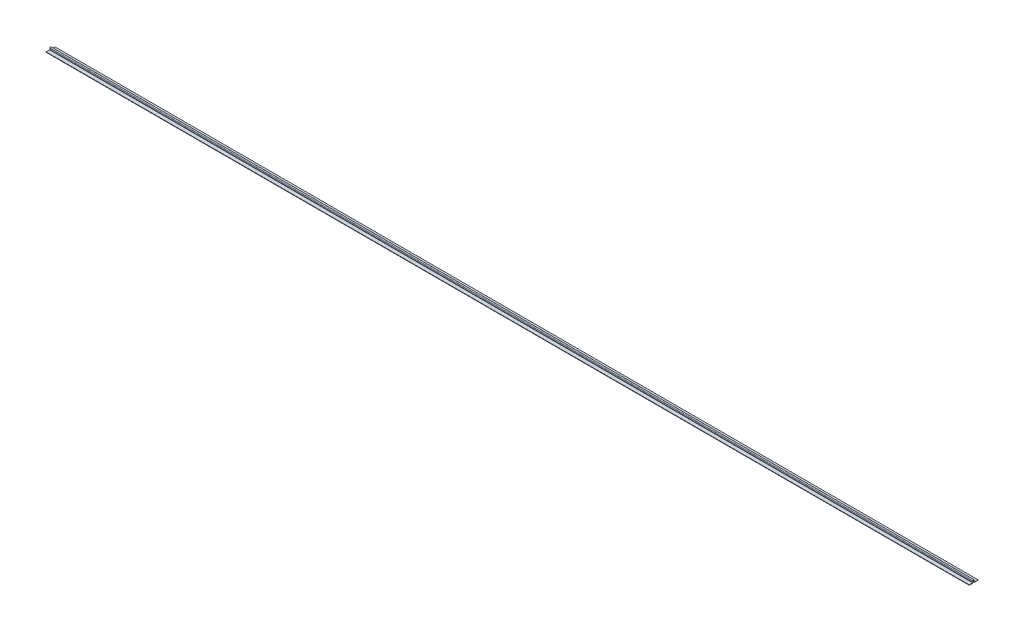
ISO-10303-21;
HEADER;
FILE_DESCRIPTION(('STEP AP214'),'2;1');
FILE_NAME('part.step','',(''),(''),'','','');
FILE_SCHEMA(('AUTOMOTIVE_DESIGN { 1 0 10303 214 1 1 1 1 }'));
ENDSEC;
DATA;
#1=APPLICATION_CONTEXT('core data for automotive mechanical design processes');
#2=APPLICATION_PROTOCOL_DEFINITION('international standard','automotive_design',2000,#1);
#3=PRODUCT_CONTEXT('',#1,'mechanical');
#4=PRODUCT('Part','Part','',(#3));
#5=PRODUCT_RELATED_PRODUCT_CATEGORY('part','',(#4));
#6=PRODUCT_DEFINITION_FORMATION('','',#4);
#7=PRODUCT_DEFINITION_CONTEXT('part definition',#1,'design');
#8=PRODUCT_DEFINITION('design','',#6,#7);
#9=PRODUCT_DEFINITION_SHAPE('','',#8);
#10=(LENGTH_UNIT() NAMED_UNIT(*) SI_UNIT(.MILLI.,.METRE.));
#11=(NAMED_UNIT(*) PLANE_ANGLE_UNIT() SI_UNIT($,.RADIAN.));
#12=(NAMED_UNIT(*) SI_UNIT($,.STERADIAN.) SOLID_ANGLE_UNIT());
#13=UNCERTAINTY_MEASURE_WITH_UNIT(LENGTH_MEASURE(1.E-05),#10,'distance_accuracy_value','');
#14=(GEOMETRIC_REPRESENTATION_CONTEXT(3) GLOBAL_UNCERTAINTY_ASSIGNED_CONTEXT((#13)) GLOBAL_UNIT_ASSIGNED_CONTEXT((#10,
#11,#12)) REPRESENTATION_CONTEXT('',''));
#15=CARTESIAN_POINT('',(0.,0.,0.));
#16=DIRECTION('',(0.,0.,1.));
#17=DIRECTION('',(1.,0.,0.));
#18=AXIS2_PLACEMENT_3D('',#15,#16,#17);
#19=CARTESIAN_POINT('',(1227.5,4.,-1.75));
#20=DIRECTION('',(0.,0.,-1.));
#21=DIRECTION('',(0.,1.,0.));
#22=AXIS2_PLACEMENT_3D('',#19,#20,#21);
#23=PLANE('',#22);
#24=DIRECTION('',(0.,-1.,0.));
#25=VECTOR('',#24,1.);
#26=CARTESIAN_POINT('',(-1227.5,4.,-1.75));
#27=LINE('',#26,#25);
#28=CARTESIAN_POINT('',(-1227.5,4.,-1.75));
#29=VERTEX_POINT('',#28);
#30=CARTESIAN_POINT('',(-1227.5,0.5,-1.75));
#31=VERTEX_POINT('',#30);
#32=EDGE_CURVE('E179',#29,#31,#27,.T.);
#33=ORIENTED_EDGE('',*,*,#32,.F.);
#34=DIRECTION('',(-1.,0.,0.));
#35=VECTOR('',#34,1.);
#36=CARTESIAN_POINT('',(1227.5,4.,-1.75));
#37=LINE('',#36,#35);
#38=CARTESIAN_POINT('',(1227.5,4.,-1.75));
#39=VERTEX_POINT('',#38);
#40=EDGE_CURVE('E11',#39,#29,#37,.T.);
#41=ORIENTED_EDGE('',*,*,#40,.F.);
#42=DIRECTION('',(0.,-1.,0.));
#43=VECTOR('',#42,1.);
#44=CARTESIAN_POINT('',(1227.5,4.,-1.75));
#45=LINE('',#44,#43);
#46=CARTESIAN_POINT('',(1227.5,0.5,-1.75));
#47=VERTEX_POINT('',#46);
#48=EDGE_CURVE('E218',#39,#47,#45,.T.);
#49=ORIENTED_EDGE('',*,*,#48,.T.);
#50=DIRECTION('',(-1.,0.,0.));
#51=VECTOR('',#50,1.);
#52=CARTESIAN_POINT('',(1227.5,0.5,-1.75));
#53=LINE('',#52,#51);
#54=EDGE_CURVE('E36',#47,#31,#53,.T.);
#55=ORIENTED_EDGE('',*,*,#54,.T.);
#56=EDGE_LOOP('',(#33,#41,#49,#55));
#57=FACE_BOUND('',#56,.T.);
#58=ADVANCED_FACE('F33',(#57),#23,.T.);
#59=CARTESIAN_POINT('',(1227.5,4.,0.));
#60=DIRECTION('',(-1.,0.,0.));
#61=DIRECTION('',(0.,0.,1.));
#62=AXIS2_PLACEMENT_3D('',#59,#60,#61);
#63=CYLINDRICAL_SURFACE('',#62,1.75);
#64=CARTESIAN_POINT('',(-1227.5,4.,0.));
#65=DIRECTION('',(1.,0.,0.));
#66=DIRECTION('',(0.,0.,-1.));
#67=AXIS2_PLACEMENT_3D('',#64,#65,#66);
#68=CIRCLE('',#67,1.75);
#69=CARTESIAN_POINT('',(-1227.5,4.,1.75));
#70=VERTEX_POINT('',#69);
#71=EDGE_CURVE('E102',#29,#70,#68,.T.);
#72=ORIENTED_EDGE('',*,*,#71,.T.);
#73=DIRECTION('',(-1.,0.,0.));
#74=VECTOR('',#73,1.);
#75=CARTESIAN_POINT('',(1227.5,4.,1.75));
#76=LINE('',#75,#74);
#77=CARTESIAN_POINT('',(1227.5,4.,1.75));
#78=VERTEX_POINT('',#77);
#79=EDGE_CURVE('E42',#78,#70,#76,.T.);
#80=ORIENTED_EDGE('',*,*,#79,.F.);
#81=CARTESIAN_POINT('',(1227.5,4.,0.));
#82=DIRECTION('',(1.,0.,0.));
#83=DIRECTION('',(0.,0.,-1.));
#84=AXIS2_PLACEMENT_3D('',#81,#82,#83);
#85=CIRCLE('',#84,1.75);
#86=EDGE_CURVE('E157',#39,#78,#85,.T.);
#87=ORIENTED_EDGE('',*,*,#86,.F.);
#88=ORIENTED_EDGE('',*,*,#40,.T.);
#89=EDGE_LOOP('',(#72,#80,#87,#88));
#90=FACE_BOUND('',#89,.T.);
#91=ADVANCED_FACE('F332',(#90),#63,.T.);
#92=CARTESIAN_POINT('',(1227.5,4.,1.75));
#93=DIRECTION('',(0.,0.,-1.));
#94=DIRECTION('',(0.,1.,0.));
#95=AXIS2_PLACEMENT_3D('',#92,#93,#94);
#96=PLANE('',#95);
#97=DIRECTION('',(0.,-1.,0.));
#98=VECTOR('',#97,1.);
#99=CARTESIAN_POINT('',(-1227.5,4.,1.75));
#100=LINE('',#99,#98);
#101=CARTESIAN_POINT('',(-1227.5,0.5,1.75));
#102=VERTEX_POINT('',#101);
#103=EDGE_CURVE('E164',#70,#102,#100,.T.);
#104=ORIENTED_EDGE('',*,*,#103,.T.);
#105=DIRECTION('',(-1.,0.,0.));
#106=VECTOR('',#105,1.);
#107=CARTESIAN_POINT('',(1227.5,0.5,1.75));
#108=LINE('',#107,#106);
#109=CARTESIAN_POINT('',(1227.5,0.5,1.75));
#110=VERTEX_POINT('',#109);
#111=EDGE_CURVE('E161',#110,#102,#108,.T.);
#112=ORIENTED_EDGE('',*,*,#111,.F.);
#113=DIRECTION('',(0.,-1.,0.));
#114=VECTOR('',#113,1.);
#115=CARTESIAN_POINT('',(1227.5,4.,1.75));
#116=LINE('',#115,#114);
#117=EDGE_CURVE('E151',#78,#110,#116,.T.);
#118=ORIENTED_EDGE('',*,*,#117,.F.);
#119=ORIENTED_EDGE('',*,*,#79,.T.);
#120=EDGE_LOOP('',(#104,#112,#118,#119));
#121=FACE_BOUND('',#120,.T.);
#122=ADVANCED_FACE('F162',(#121),#96,.F.);
#123=CARTESIAN_POINT('',(1227.5,0.5,2.25));
#124=DIRECTION('',(-1.,0.,0.));
#125=DIRECTION('',(0.,0.,1.));
#126=AXIS2_PLACEMENT_3D('',#123,#124,#125);
#127=CYLINDRICAL_SURFACE('',#126,0.5);
#128=CARTESIAN_POINT('',(-1227.5,0.5,2.25));
#129=DIRECTION('',(-1.,0.,0.));
#130=DIRECTION('',(0.,0.,1.));
#131=AXIS2_PLACEMENT_3D('',#128,#129,#130);
#132=CIRCLE('',#131,0.5);
#133=CARTESIAN_POINT('',(-1227.5,0.,2.25));
#134=VERTEX_POINT('',#133);
#135=EDGE_CURVE('E215',#102,#134,#132,.T.);
#136=ORIENTED_EDGE('',*,*,#135,.T.);
#137=DIRECTION('',(-1.,0.,0.));
#138=VECTOR('',#137,1.);
#139=CARTESIAN_POINT('',(1227.5,0.,2.25));
#140=LINE('',#139,#138);
#141=CARTESIAN_POINT('',(1227.5,0.,2.25));
#142=VERTEX_POINT('',#141);
#143=EDGE_CURVE('E167',#142,#134,#140,.T.);
#144=ORIENTED_EDGE('',*,*,#143,.F.);
#145=CARTESIAN_POINT('',(1227.5,0.5,2.25));
#146=DIRECTION('',(-1.,0.,0.));
#147=DIRECTION('',(0.,0.,1.));
#148=AXIS2_PLACEMENT_3D('',#145,#146,#147);
#149=CIRCLE('',#148,0.5);
#150=EDGE_CURVE('E155',#110,#142,#149,.T.);
#151=ORIENTED_EDGE('',*,*,#150,.F.);
#152=ORIENTED_EDGE('',*,*,#111,.T.);
#153=EDGE_LOOP('',(#136,#144,#151,#152));
#154=FACE_BOUND('',#153,.T.);
#155=ADVANCED_FACE('F169',(#154),#127,.F.);
#156=CARTESIAN_POINT('',(1227.5,0.,2.25));
#157=DIRECTION('',(0.,-1.,0.));
#158=DIRECTION('',(0.,0.,-1.));
#159=AXIS2_PLACEMENT_3D('',#156,#157,#158);
#160=PLANE('',#159);
#161=DIRECTION('',(0.,0.,1.));
#162=VECTOR('',#161,1.);
#163=CARTESIAN_POINT('',(-1227.5,0.,2.25));
#164=LINE('',#163,#162);
#165=CARTESIAN_POINT('',(-1227.5,0.,11.75));
#166=VERTEX_POINT('',#165);
#167=EDGE_CURVE('E213',#134,#166,#164,.T.);
#168=ORIENTED_EDGE('',*,*,#167,.T.);
#169=DIRECTION('',(-1.,0.,0.));
#170=VECTOR('',#169,1.);
#171=CARTESIAN_POINT('',(1227.5,0.,11.75));
#172=LINE('',#171,#170);
#173=CARTESIAN_POINT('',(1227.5,0.,11.75));
#174=VERTEX_POINT('',#173);
#175=EDGE_CURVE('E222',#174,#166,#172,.T.);
#176=ORIENTED_EDGE('',*,*,#175,.F.);
#177=DIRECTION('',(0.,0.,1.));
#178=VECTOR('',#177,1.);
#179=CARTESIAN_POINT('',(1227.5,0.,2.25));
#180=LINE('',#179,#178);
#181=EDGE_CURVE('E172',#142,#174,#180,.T.);
#182=ORIENTED_EDGE('',*,*,#181,.F.);
#183=ORIENTED_EDGE('',*,*,#143,.T.);
#184=EDGE_LOOP('',(#168,#176,#182,#183));
#185=FACE_BOUND('',#184,.T.);
#186=ADVANCED_FACE('F255',(#185),#160,.F.);
#187=CARTESIAN_POINT('',(1227.5,0.,11.75));
#188=DIRECTION('',(0.,0.,-1.));
#189=DIRECTION('',(-1.,0.,0.));
#190=AXIS2_PLACEMENT_3D('',#187,#188,#189);
#191=PLANE('',#190);
#192=DIRECTION('',(0.,-1.,0.));
#193=VECTOR('',#192,1.);
#194=CARTESIAN_POINT('',(-1227.5,0.,11.75));
#195=LINE('',#194,#193);
#196=CARTESIAN_POINT('',(-1227.5,-1.,11.75));
#197=VERTEX_POINT('',#196);
#198=EDGE_CURVE('E211',#166,#197,#195,.T.);
#199=ORIENTED_EDGE('',*,*,#198,.T.);
#200=DIRECTION('',(-1.,0.,0.));
#201=VECTOR('',#200,1.);
#202=CARTESIAN_POINT('',(1227.5,-1.,11.75));
#203=LINE('',#202,#201);
#204=CARTESIAN_POINT('',(1227.5,-1.,11.75));
#205=VERTEX_POINT('',#204);
#206=EDGE_CURVE('E225',#205,#197,#203,.T.);
#207=ORIENTED_EDGE('',*,*,#206,.F.);
#208=DIRECTION('',(0.,-1.,0.));
#209=VECTOR('',#208,1.);
#210=CARTESIAN_POINT('',(1227.5,0.,11.75));
#211=LINE('',#210,#209);
#212=EDGE_CURVE('E174',#174,#205,#211,.T.);
#213=ORIENTED_EDGE('',*,*,#212,.F.);
#214=ORIENTED_EDGE('',*,*,#175,.T.);
#215=EDGE_LOOP('',(#199,#207,#213,#214));
#216=FACE_BOUND('',#215,.T.);
#217=ADVANCED_FACE('F264',(#216),#191,.F.);
#218=CARTESIAN_POINT('',(1227.5,-1.,11.75));
#219=DIRECTION('',(0.,1.,0.));
#220=DIRECTION('',(0.,0.,1.));
#221=AXIS2_PLACEMENT_3D('',#218,#219,#220);
#222=PLANE('',#221);
#223=DIRECTION('',(0.,0.,-1.));
#224=VECTOR('',#223,1.);
#225=CARTESIAN_POINT('',(-1227.5,-1.,11.75));
#226=LINE('',#225,#224);
#227=CARTESIAN_POINT('',(-1227.5,-1.,1.75));
#228=VERTEX_POINT('',#227);
#229=EDGE_CURVE('E208',#197,#228,#226,.T.);
#230=ORIENTED_EDGE('',*,*,#229,.T.);
#231=DIRECTION('',(-1.,0.,0.));
#232=VECTOR('',#231,1.);
#233=CARTESIAN_POINT('',(1227.5,-1.,1.75));
#234=LINE('',#233,#232);
#235=CARTESIAN_POINT('',(1227.5,-1.,1.75));
#236=VERTEX_POINT('',#235);
#237=EDGE_CURVE('E228',#236,#228,#234,.T.);
#238=ORIENTED_EDGE('',*,*,#237,.F.);
#239=DIRECTION('',(0.,0.,-1.));
#240=VECTOR('',#239,1.);
#241=CARTESIAN_POINT('',(1227.5,-1.,11.75));
#242=LINE('',#241,#240);
#243=EDGE_CURVE('E261',#205,#236,#242,.T.);
#244=ORIENTED_EDGE('',*,*,#243,.F.);
#245=ORIENTED_EDGE('',*,*,#206,.T.);
#246=EDGE_LOOP('',(#230,#238,#244,#245));
#247=FACE_BOUND('',#246,.T.);
#248=ADVANCED_FACE('F267',(#247),#222,.F.);
#249=CARTESIAN_POINT('',(1227.5,0.,1.75));
#250=DIRECTION('',(-1.,0.,0.));
#251=DIRECTION('',(0.,0.,1.));
#252=AXIS2_PLACEMENT_3D('',#249,#250,#251);
#253=CYLINDRICAL_SURFACE('',#252,1.);
#254=CARTESIAN_POINT('',(-1227.5,0.,1.75));
#255=DIRECTION('',(-1.,0.,0.));
#256=DIRECTION('',(0.,0.,1.));
#257=AXIS2_PLACEMENT_3D('',#254,#255,#256);
#258=CIRCLE('',#257,1.);
#259=CARTESIAN_POINT('',(-1227.5,0.,0.749999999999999));
#260=VERTEX_POINT('',#259);
#261=EDGE_CURVE('E205',#260,#228,#258,.T.);
#262=ORIENTED_EDGE('',*,*,#261,.F.);
#263=DIRECTION('',(-1.,0.,0.));
#264=VECTOR('',#263,1.);
#265=CARTESIAN_POINT('',(1227.5,0.,0.749999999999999));
#266=LINE('',#265,#264);
#267=CARTESIAN_POINT('',(1227.5,0.,0.749999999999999));
#268=VERTEX_POINT('',#267);
#269=EDGE_CURVE('E230',#268,#260,#266,.T.);
#270=ORIENTED_EDGE('',*,*,#269,.F.);
#271=CARTESIAN_POINT('',(1227.5,0.,1.75));
#272=DIRECTION('',(-1.,0.,0.));
#273=DIRECTION('',(0.,0.,1.));
#274=AXIS2_PLACEMENT_3D('',#271,#272,#273);
#275=CIRCLE('',#274,1.);
#276=EDGE_CURVE('E269',#268,#236,#275,.T.);
#277=ORIENTED_EDGE('',*,*,#276,.T.);
#278=ORIENTED_EDGE('',*,*,#237,.T.);
#279=EDGE_LOOP('',(#262,#270,#277,#278));
#280=FACE_BOUND('',#279,.T.);
#281=ADVANCED_FACE('F322',(#280),#253,.T.);
#282=CARTESIAN_POINT('',(1227.5,0.5,0.749999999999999));
#283=DIRECTION('',(0.,0.,-1.));
#284=DIRECTION('',(-1.,0.,0.));
#285=AXIS2_PLACEMENT_3D('',#282,#283,#284);
#286=PLANE('',#285);
#287=DIRECTION('',(0.,-1.,0.));
#288=VECTOR('',#287,1.);
#289=CARTESIAN_POINT('',(-1227.5,0.5,0.749999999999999));
#290=LINE('',#289,#288);
#291=CARTESIAN_POINT('',(-1227.5,4.,0.75));
#292=VERTEX_POINT('',#291);
#293=EDGE_CURVE('E202',#292,#260,#290,.T.);
#294=ORIENTED_EDGE('',*,*,#293,.F.);
#295=DIRECTION('',(-1.,0.,0.));
#296=VECTOR('',#295,1.);
#297=CARTESIAN_POINT('',(1227.5,4.,0.75));
#298=LINE('',#297,#296);
#299=CARTESIAN_POINT('',(1227.5,4.,0.75));
#300=VERTEX_POINT('',#299);
#301=EDGE_CURVE('E232',#300,#292,#298,.T.);
#302=ORIENTED_EDGE('',*,*,#301,.F.);
#303=DIRECTION('',(0.,-1.,0.));
#304=VECTOR('',#303,1.);
#305=CARTESIAN_POINT('',(1227.5,4.,0.75));
#306=LINE('',#305,#304);
#307=EDGE_CURVE('E271',#300,#268,#306,.T.);
#308=ORIENTED_EDGE('',*,*,#307,.T.);
#309=ORIENTED_EDGE('',*,*,#269,.T.);
#310=EDGE_LOOP('',(#294,#302,#308,#309));
#311=FACE_BOUND('',#310,.T.);
#312=ADVANCED_FACE('F318',(#311),#286,.T.);
#313=CARTESIAN_POINT('',(1227.5,4.,0.));
#314=DIRECTION('',(-1.,0.,0.));
#315=DIRECTION('',(0.,0.,1.));
#316=AXIS2_PLACEMENT_3D('',#313,#314,#315);
#317=CYLINDRICAL_SURFACE('',#316,0.75);
#318=CARTESIAN_POINT('',(-1227.5,4.,0.));
#319=DIRECTION('',(1.,0.,0.));
#320=DIRECTION('',(0.,0.,-1.));
#321=AXIS2_PLACEMENT_3D('',#318,#319,#320);
#322=CIRCLE('',#321,0.75);
#323=CARTESIAN_POINT('',(-1227.5,4.,-0.75));
#324=VERTEX_POINT('',#323);
#325=EDGE_CURVE('E199',#324,#292,#322,.T.);
#326=ORIENTED_EDGE('',*,*,#325,.F.);
#327=DIRECTION('',(-1.,0.,0.));
#328=VECTOR('',#327,1.);
#329=CARTESIAN_POINT('',(1227.5,4.,-0.75));
#330=LINE('',#329,#328);
#331=CARTESIAN_POINT('',(1227.5,4.,-0.75));
#332=VERTEX_POINT('',#331);
#333=EDGE_CURVE('E235',#332,#324,#330,.T.);
#334=ORIENTED_EDGE('',*,*,#333,.F.);
#335=CARTESIAN_POINT('',(1227.5,4.,0.));
#336=DIRECTION('',(1.,0.,0.));
#337=DIRECTION('',(0.,0.,-1.));
#338=AXIS2_PLACEMENT_3D('',#335,#336,#337);
#339=CIRCLE('',#338,0.75);
#340=EDGE_CURVE('E275',#332,#300,#339,.T.);
#341=ORIENTED_EDGE('',*,*,#340,.T.);
#342=ORIENTED_EDGE('',*,*,#301,.T.);
#343=EDGE_LOOP('',(#326,#334,#341,#342));
#344=FACE_BOUND('',#343,.T.);
#345=ADVANCED_FACE('F314',(#344),#317,.F.);
#346=CARTESIAN_POINT('',(1227.5,4.,-0.75));
#347=DIRECTION('',(0.,0.,-1.));
#348=DIRECTION('',(0.,1.,0.));
#349=AXIS2_PLACEMENT_3D('',#346,#347,#348);
#350=PLANE('',#349);
#351=DIRECTION('',(0.,-1.,0.));
#352=VECTOR('',#351,1.);
#353=CARTESIAN_POINT('',(-1227.5,4.,-0.75));
#354=LINE('',#353,#352);
#355=CARTESIAN_POINT('',(-1227.5,0.,-0.75));
#356=VERTEX_POINT('',#355);
#357=EDGE_CURVE('E197',#324,#356,#354,.T.);
#358=ORIENTED_EDGE('',*,*,#357,.T.);
#359=DIRECTION('',(-1.,0.,0.));
#360=VECTOR('',#359,1.);
#361=CARTESIAN_POINT('',(1227.5,0.,-0.75));
#362=LINE('',#361,#360);
#363=CARTESIAN_POINT('',(1227.5,0.,-0.75));
#364=VERTEX_POINT('',#363);
#365=EDGE_CURVE('E237',#364,#356,#362,.T.);
#366=ORIENTED_EDGE('',*,*,#365,.F.);
#367=DIRECTION('',(0.,-1.,0.));
#368=VECTOR('',#367,1.);
#369=CARTESIAN_POINT('',(1227.5,0.5,-0.75));
#370=LINE('',#369,#368);
#371=EDGE_CURVE('E278',#332,#364,#370,.T.);
#372=ORIENTED_EDGE('',*,*,#371,.F.);
#373=ORIENTED_EDGE('',*,*,#333,.T.);
#374=EDGE_LOOP('',(#358,#366,#372,#373));
#375=FACE_BOUND('',#374,.T.);
#376=ADVANCED_FACE('F310',(#375),#350,.F.);
#377=CARTESIAN_POINT('',(1227.5,0.,-1.75));
#378=DIRECTION('',(-1.,0.,0.));
#379=DIRECTION('',(0.,0.,1.));
#380=AXIS2_PLACEMENT_3D('',#377,#378,#379);
#381=CYLINDRICAL_SURFACE('',#380,1.);
#382=CARTESIAN_POINT('',(-1227.5,0.,-1.75));
#383=DIRECTION('',(-1.,0.,0.));
#384=DIRECTION('',(0.,0.,1.));
#385=AXIS2_PLACEMENT_3D('',#382,#383,#384);
#386=CIRCLE('',#385,1.);
#387=CARTESIAN_POINT('',(-1227.5,-1.,-1.75));
#388=VERTEX_POINT('',#387);
#389=EDGE_CURVE('E194',#388,#356,#386,.T.);
#390=ORIENTED_EDGE('',*,*,#389,.F.);
#391=DIRECTION('',(-1.,0.,0.));
#392=VECTOR('',#391,1.);
#393=CARTESIAN_POINT('',(1227.5,-1.,-1.75));
#394=LINE('',#393,#392);
#395=CARTESIAN_POINT('',(1227.5,-1.,-1.75));
#396=VERTEX_POINT('',#395);
#397=EDGE_CURVE('E240',#396,#388,#394,.T.);
#398=ORIENTED_EDGE('',*,*,#397,.F.);
#399=CARTESIAN_POINT('',(1227.5,0.,-1.75));
#400=DIRECTION('',(-1.,0.,0.));
#401=DIRECTION('',(0.,0.,1.));
#402=AXIS2_PLACEMENT_3D('',#399,#400,#401);
#403=CIRCLE('',#402,1.);
#404=EDGE_CURVE('E280',#396,#364,#403,.T.);
#405=ORIENTED_EDGE('',*,*,#404,.T.);
#406=ORIENTED_EDGE('',*,*,#365,.T.);
#407=EDGE_LOOP('',(#390,#398,#405,#406));
#408=FACE_BOUND('',#407,.T.);
#409=ADVANCED_FACE('F307',(#408),#381,.T.);
#410=CARTESIAN_POINT('',(1227.5,-1.,-11.75));
#411=DIRECTION('',(0.,-1.,0.));
#412=DIRECTION('',(0.,0.,-1.));
#413=AXIS2_PLACEMENT_3D('',#410,#411,#412);
#414=PLANE('',#413);
#415=DIRECTION('',(0.,0.,1.));
#416=VECTOR('',#415,1.);
#417=CARTESIAN_POINT('',(-1227.5,-1.,-11.75));
#418=LINE('',#417,#416);
#419=CARTESIAN_POINT('',(-1227.5,-1.,-11.75));
#420=VERTEX_POINT('',#419);
#421=EDGE_CURVE('E191',#420,#388,#418,.T.);
#422=ORIENTED_EDGE('',*,*,#421,.F.);
#423=DIRECTION('',(-1.,0.,0.));
#424=VECTOR('',#423,1.);
#425=CARTESIAN_POINT('',(1227.5,-1.,-11.75));
#426=LINE('',#425,#424);
#427=CARTESIAN_POINT('',(1227.5,-1.,-11.75));
#428=VERTEX_POINT('',#427);
#429=EDGE_CURVE('E242',#428,#420,#426,.T.);
#430=ORIENTED_EDGE('',*,*,#429,.F.);
#431=DIRECTION('',(0.,0.,1.));
#432=VECTOR('',#431,1.);
#433=CARTESIAN_POINT('',(1227.5,-1.,-11.75));
#434=LINE('',#433,#432);
#435=EDGE_CURVE('E283',#428,#396,#434,.T.);
#436=ORIENTED_EDGE('',*,*,#435,.T.);
#437=ORIENTED_EDGE('',*,*,#397,.T.);
#438=EDGE_LOOP('',(#422,#430,#436,#437));
#439=FACE_BOUND('',#438,.T.);
#440=ADVANCED_FACE('F305',(#439),#414,.T.);
#441=CARTESIAN_POINT('',(1227.5,0.,-11.75));
#442=DIRECTION('',(0.,0.,-1.));
#443=DIRECTION('',(-1.,0.,0.));
#444=AXIS2_PLACEMENT_3D('',#441,#442,#443);
#445=PLANE('',#444);
#446=DIRECTION('',(0.,-1.,0.));
#447=VECTOR('',#446,1.);
#448=CARTESIAN_POINT('',(-1227.5,0.,-11.75));
#449=LINE('',#448,#447);
#450=CARTESIAN_POINT('',(-1227.5,0.,-11.75));
#451=VERTEX_POINT('',#450);
#452=EDGE_CURVE('E188',#451,#420,#449,.T.);
#453=ORIENTED_EDGE('',*,*,#452,.F.);
#454=DIRECTION('',(-1.,0.,0.));
#455=VECTOR('',#454,1.);
#456=CARTESIAN_POINT('',(1227.5,0.,-11.75));
#457=LINE('',#456,#455);
#458=CARTESIAN_POINT('',(1227.5,0.,-11.75));
#459=VERTEX_POINT('',#458);
#460=EDGE_CURVE('E244',#459,#451,#457,.T.);
#461=ORIENTED_EDGE('',*,*,#460,.F.);
#462=DIRECTION('',(0.,-1.,0.));
#463=VECTOR('',#462,1.);
#464=CARTESIAN_POINT('',(1227.5,0.,-11.75));
#465=LINE('',#464,#463);
#466=EDGE_CURVE('E286',#459,#428,#465,.T.);
#467=ORIENTED_EDGE('',*,*,#466,.T.);
#468=ORIENTED_EDGE('',*,*,#429,.T.);
#469=EDGE_LOOP('',(#453,#461,#467,#468));
#470=FACE_BOUND('',#469,.T.);
#471=ADVANCED_FACE('F300',(#470),#445,.T.);
#472=CARTESIAN_POINT('',(1227.5,0.,-2.25));
#473=DIRECTION('',(0.,1.,0.));
#474=DIRECTION('',(0.,0.,1.));
#475=AXIS2_PLACEMENT_3D('',#472,#473,#474);
#476=PLANE('',#475);
#477=DIRECTION('',(0.,0.,-1.));
#478=VECTOR('',#477,1.);
#479=CARTESIAN_POINT('',(-1227.5,0.,-2.25));
#480=LINE('',#479,#478);
#481=CARTESIAN_POINT('',(-1227.5,0.,-2.25));
#482=VERTEX_POINT('',#481);
#483=EDGE_CURVE('E185',#482,#451,#480,.T.);
#484=ORIENTED_EDGE('',*,*,#483,.F.);
#485=DIRECTION('',(-1.,0.,0.));
#486=VECTOR('',#485,1.);
#487=CARTESIAN_POINT('',(1227.5,0.,-2.25));
#488=LINE('',#487,#486);
#489=CARTESIAN_POINT('',(1227.5,0.,-2.25));
#490=VERTEX_POINT('',#489);
#491=EDGE_CURVE('E245',#490,#482,#488,.T.);
#492=ORIENTED_EDGE('',*,*,#491,.F.);
#493=DIRECTION('',(0.,0.,-1.));
#494=VECTOR('',#493,1.);
#495=CARTESIAN_POINT('',(1227.5,0.,-2.25));
#496=LINE('',#495,#494);
#497=EDGE_CURVE('E289',#490,#459,#496,.T.);
#498=ORIENTED_EDGE('',*,*,#497,.T.);
#499=ORIENTED_EDGE('',*,*,#460,.T.);
#500=EDGE_LOOP('',(#484,#492,#498,#499));
#501=FACE_BOUND('',#500,.T.);
#502=ADVANCED_FACE('F294',(#501),#476,.T.);
#503=CARTESIAN_POINT('',(1227.5,0.5,-2.25));
#504=DIRECTION('',(-1.,0.,0.));
#505=DIRECTION('',(0.,0.,1.));
#506=AXIS2_PLACEMENT_3D('',#503,#504,#505);
#507=CYLINDRICAL_SURFACE('',#506,0.5);
#508=CARTESIAN_POINT('',(-1227.5,0.5,-2.25));
#509=DIRECTION('',(-1.,0.,0.));
#510=DIRECTION('',(0.,0.,1.));
#511=AXIS2_PLACEMENT_3D('',#508,#509,#510);
#512=CIRCLE('',#511,0.5);
#513=EDGE_CURVE('E182',#482,#31,#512,.T.);
#514=ORIENTED_EDGE('',*,*,#513,.T.);
#515=ORIENTED_EDGE('',*,*,#54,.F.);
#516=CARTESIAN_POINT('',(1227.5,0.5,-2.25));
#517=DIRECTION('',(-1.,0.,0.));
#518=DIRECTION('',(0.,0.,1.));
#519=AXIS2_PLACEMENT_3D('',#516,#517,#518);
#520=CIRCLE('',#519,0.5);
#521=EDGE_CURVE('E112',#490,#47,#520,.T.);
#522=ORIENTED_EDGE('',*,*,#521,.F.);
#523=ORIENTED_EDGE('',*,*,#491,.T.);
#524=EDGE_LOOP('',(#514,#515,#522,#523));
#525=FACE_BOUND('',#524,.T.);
#526=ADVANCED_FACE('F248',(#525),#507,.F.);
#527=CARTESIAN_POINT('',(1227.5,0.5,-2.25));
#528=DIRECTION('',(-1.,0.,0.));
#529=DIRECTION('',(0.,0.,1.));
#530=AXIS2_PLACEMENT_3D('',#527,#528,#529);
#531=PLANE('',#530);
#532=ORIENTED_EDGE('',*,*,#48,.F.);
#533=ORIENTED_EDGE('',*,*,#86,.T.);
#534=ORIENTED_EDGE('',*,*,#117,.T.);
#535=ORIENTED_EDGE('',*,*,#150,.T.);
#536=ORIENTED_EDGE('',*,*,#181,.T.);
#537=ORIENTED_EDGE('',*,*,#212,.T.);
#538=ORIENTED_EDGE('',*,*,#243,.T.);
#539=ORIENTED_EDGE('',*,*,#276,.F.);
#540=ORIENTED_EDGE('',*,*,#307,.F.);
#541=ORIENTED_EDGE('',*,*,#340,.F.);
#542=ORIENTED_EDGE('',*,*,#371,.T.);
#543=ORIENTED_EDGE('',*,*,#404,.F.);
#544=ORIENTED_EDGE('',*,*,#435,.F.);
#545=ORIENTED_EDGE('',*,*,#466,.F.);
#546=ORIENTED_EDGE('',*,*,#497,.F.);
#547=ORIENTED_EDGE('',*,*,#521,.T.);
#548=EDGE_LOOP('',(#532,#533,#534,#535,#536,#537,#538,#539,#540,#541,#542,#543,#544,#545,#546,#547));
#549=FACE_BOUND('',#548,.T.);
#550=ADVANCED_FACE('F153',(#549),#531,.F.);
#551=CARTESIAN_POINT('',(-1227.5,0.5,-2.25));
#552=DIRECTION('',(-1.,0.,0.));
#553=DIRECTION('',(0.,0.,1.));
#554=AXIS2_PLACEMENT_3D('',#551,#552,#553);
#555=PLANE('',#554);
#556=ORIENTED_EDGE('',*,*,#32,.T.);
#557=ORIENTED_EDGE('',*,*,#513,.F.);
#558=ORIENTED_EDGE('',*,*,#483,.T.);
#559=ORIENTED_EDGE('',*,*,#452,.T.);
#560=ORIENTED_EDGE('',*,*,#421,.T.);
#561=ORIENTED_EDGE('',*,*,#389,.T.);
#562=ORIENTED_EDGE('',*,*,#357,.F.);
#563=ORIENTED_EDGE('',*,*,#325,.T.);
#564=ORIENTED_EDGE('',*,*,#293,.T.);
#565=ORIENTED_EDGE('',*,*,#261,.T.);
#566=ORIENTED_EDGE('',*,*,#229,.F.);
#567=ORIENTED_EDGE('',*,*,#198,.F.);
#568=ORIENTED_EDGE('',*,*,#167,.F.);
#569=ORIENTED_EDGE('',*,*,#135,.F.);
#570=ORIENTED_EDGE('',*,*,#103,.F.);
#571=ORIENTED_EDGE('',*,*,#71,.F.);
#572=EDGE_LOOP('',(#556,#557,#558,#559,#560,#561,#562,#563,#564,#565,#566,#567,#568,#569,#570,#571));
#573=FACE_BOUND('',#572,.T.);
#574=ADVANCED_FACE('F251',(#573),#555,.T.);
#575=CLOSED_SHELL('',(#58,#91,#122,#155,#186,#217,#248,#281,#312,#345,#376,#409,#440,#471,#502,
#526,#550,#574));
#576=MANIFOLD_SOLID_BREP('B2',#575);
#577=ADVANCED_BREP_SHAPE_REPRESENTATION('',(#18,#576),#14);
#578=SHAPE_DEFINITION_REPRESENTATION(#9,#577);
ENDSEC;
END-ISO-10303-21;
